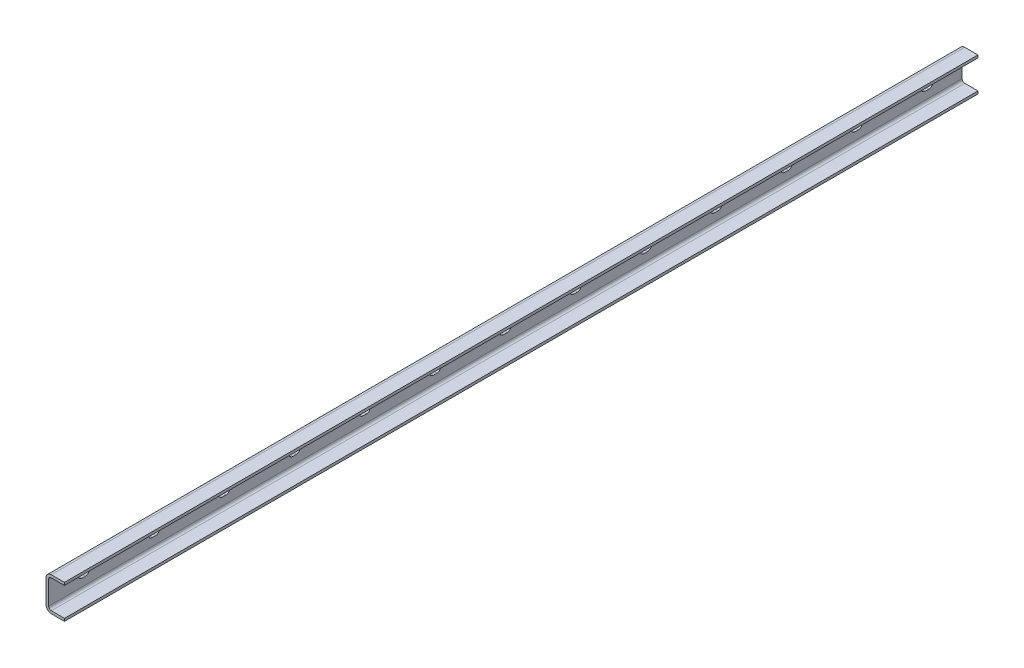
from build123d import *

# Parameters (mm, degrees)
BOSS_EXTRUDE1_DEPTH = 1040
CUT_EXTRUDE1_DEPTH  = 1041.333870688
LPATTERN1_COUNT     = 13
LPATTERN1_PITCH     = 80


with BuildPart() as part:
    # Sketch1 → Boss-Extrude1 (new body)
    with BuildSketch(Plane.XY):
        with BuildLine():
            Line((21, 16.25), (21, 19.25))
            Line((21, 19.25), (6, 19.25))
            ThreePointArc((6, 19.25), (1.757359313, 17.492640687), (0, 13.25))
            Line((0, 13.25), (0, 0))
            Line((0, 0), (0, -13.25))
            ThreePointArc((0, -13.25), (1.757359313, -17.492640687), (6, -19.25))
            Line((6, -19.25), (21, -19.25))
            Line((21, -19.25), (21, -16.25))
            Line((21, -16.25), (6, -16.25))
            ThreePointArc((6, -16.25), (3.878679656, -15.371320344), (3, -13.25))
            Line((3, -13.25), (3, 13.25))
            ThreePointArc((3, 13.25), (3.878679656, 15.371320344), (6, 16.25))
            Line((6, 16.25), (21, 16.25))
        make_face()
    extrude(amount=-BOSS_EXTRUDE1_DEPTH)

    # Sketch2 → Cut-Extrude1 (cut, through all)
    with BuildSketch(Plane(origin=(3, 0, 0), x_dir=(0, 0, -1), z_dir=(1, 0, 0))):
        with BuildLine():
            Line((38, 4.5), (42, 4.5))
            ThreePointArc((42, 4.5), (46.5, 0), (42, -4.5))
            Line((42, -4.5), (38, -4.5))
            ThreePointArc((38, -4.5), (33.5, 0), (38, 4.5))
        make_face()
    cut_extrude1 = extrude(amount=-CUT_EXTRUDE1_DEPTH, mode=Mode.SUBTRACT)

    # LPattern1: Cut-Extrude1 ×13
    with Locations(*[(0, 0, -i * LPATTERN1_PITCH) for i in range(1, LPATTERN1_COUNT)]):
        add(cut_extrude1, mode=Mode.SUBTRACT)


solid = part.part
